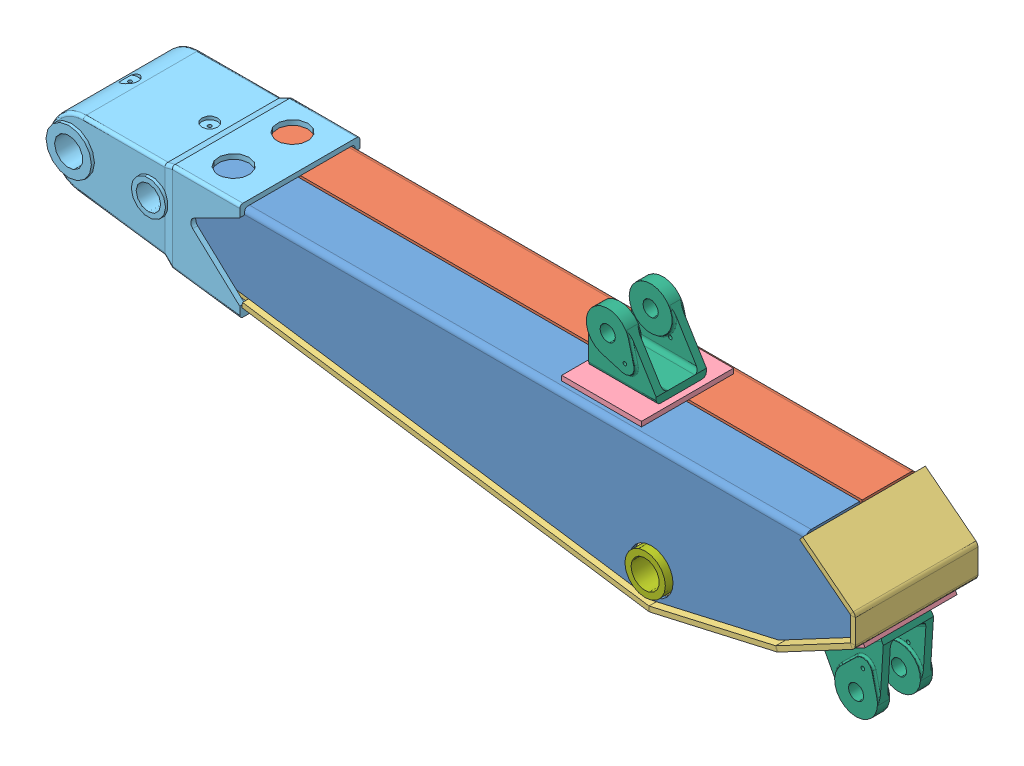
SolidWorks assembly ZLJX-XS-03-11A.SLDASM, configuration 默认 (file format 17000). Lengths in mm.
Overall size (1348.62 386.54 200).
9 component instances, 7 part files, 22 mates.
Components (placement in the parent):
- ZLJX-XS-03-11A-001-1-1: ZLJX-XS-03-11A-001-1.SLDPRT [默认] at (-817.4157 137.5187 0) size (1100 221 88)
- ZLJX-XS-03-11A-001-2-1: ZLJX-XS-03-11A-001-2.SLDPRT [默认] at (-817.4157 137.5187 -172) size (1100 221 88)
- ZLJX-XS-03-11A-002-1-1: ZLJX-XS-03-11A-002-1.SLDPRT [默认] at (285.4067 35.8717 -182) x (1 0.000022 0) z (0 0 1) size (1099.51 230.91 200)
- ZLJX-XS-03-11A-002-2-1: ZLJX-XS-03-11A-002-2.SLDPRT [默认] at (-80.4157 145.5187 -7) x (0 0 -1) z (0 1 0) size (150 130 8)
- ZLJX-Z-004-1: ZLJX-Z-004.SLDPRT [默认] at (-822.4157 92.5187 -82) x (-1 0 0) z (0 0 -1) size (314 161 200)
- ZLJX-Z-009-1: ZLJX-Z-009.SLDPRT [默认] at (225.7348 -15.1423 -82) x (0 0 -1) z (0.469799 -0.882773 0) size (90 110 102)
- ZLJX-Z-009-2: ZLJX-Z-009.SLDPRT [默认] at (-145.4157 153.5187 -82) x (0 0 1) z (0 1 0) size (90 110 102)
- ZLJX-XS-03-11A-002-2-2: ZLJX-XS-03-11A-002-2.SLDPRT [默认] at (284.173 15.9576 -7) x (0 0 -1) z (-0.469799 0.882773 0) size (150 130 8)
- ZLJX-XS-03-19-1: ZLJX-XS-03-19.SLDPRT [默认] at (-49.4157 -34.4813 -182) size (66 66 200)
Mates (geometry in assembly coordinates):
- 重合1: coincident aligned: plane of ZLJX-XS-03-11A-001-1-1 through (202.5843 145.5187 0) normal (0 1 0); plane of ZLJX-XS-03-11A-001-2-1 through (-817.4157 145.5187 -164) normal (0 1 0)
- 距离1: distance = 4 mm anti-aligned: plane of ZLJX-XS-03-11A-001-1-1 through (-817.4157 145.5187 -80) normal (0 0 -1); plane of ZLJX-XS-03-11A-001-2-1 through (-817.4157 145.5187 -84) normal (0 0 1)
- 重合3: coincident aligned: plane of ZLJX-XS-03-11A-001-1-1 through (-817.4157 145.5187 0) normal (-1 0 0); plane of ZLJX-XS-03-11A-001-2-1 through (-817.4157 145.5187 -164) normal (-1 0 0)
- 距离2: distance = 10 mm aligned: plane of ZLJX-XS-03-11A-001-1-1 through (-817.4157 137.5187 8) normal (0 0 1); plane of ZLJX-XS-03-11A-002-1-1 through (165.2677 -36.782 18) normal (0 0 1)
- 距离5: distance = 1 mm anti-aligned: plane of ZLJX-XS-03-11A-001-1-1 through (202.5843 145.5187 0) normal (0 1 0); plane of ZLJX-Z-004-1 through (-720.4157 146.5187 8) normal (0 -1 0)
- 重合9: coincident anti-aligned: plane of ZLJX-XS-03-11A-001-1-1 through (-817.4157 137.5187 8) normal (0 0 1); plane of ZLJX-Z-004-1 through (-822.4157 146.5187 8) normal (0 0 -1)
- 距离3: distance = 105 mm anti-aligned: plane of ZLJX-XS-03-11A-001-2-1 through (-817.4157 145.5187 -164) normal (-1 0 0); plane of ZLJX-Z-004-1 through (-712.4157 -6.4813 -180) normal (1 0 0)
- 重合25: coincident anti-aligned: plane of ZLJX-XS-03-11A-001-2-1 through (-47.4157 -75.4813 -164) normal (-0.145198 -0.989403 0); plane of ZLJX-XS-03-11A-002-1-1 through (-43.1056 -76.1138 18) normal (0.145198 0.989403 0)
- 距离12: distance = 3.5 mm: plane of ZLJX-XS-03-11A-002-1-1 through (-707.4574 11.2749 -182) normal (-0.989403 0.145198 0); line of ZLJX-Z-004-1 through (-712.4157 1.5928 3) axis (0 0 -1)
- 重合14: coincident anti-aligned: plane of ZLJX-XS-03-11A-001-1-1 through (202.5843 145.5187 0) normal (0 1 0); plane of ZLJX-XS-03-11A-002-2-1 through (-210.4157 145.5187 -7) normal (0 -1 0)
- 距离6: distance = 15 mm aligned: plane of ZLJX-XS-03-11A-001-1-1 through (-817.4157 137.5187 8) normal (0 0 1); plane of ZLJX-XS-03-11A-002-2-1 through (-80.4157 153.5187 -7) normal (0 0 1)
- 距离11: distance = 1 mm anti-aligned: plane of ZLJX-XS-03-11A-002-1-1 through (289.1651 28.8095 18) normal (0.469799 -0.882773 0); plane of ZLJX-XS-03-11A-002-2-2 through (165.654 -38.0541 -7) normal (-0.469799 0.882773 0)
- 重合17: coincident aligned: plane of ZLJX-XS-03-11A-002-2-1 through (-80.4157 153.5187 -7) normal (0 0 1); plane of ZLJX-XS-03-11A-002-2-2 through (280.4146 23.0198 -7) normal (0 0 1)
- 重合18: coincident anti-aligned: plane of ZLJX-XS-03-11A-002-2-1; plane of ZLJX-Z-009-2 through (-200.4157 153.5187 -123) normal (0 -1 0)
- 距离7: distance = 34 mm aligned: plane of ZLJX-XS-03-11A-002-2-1 through (-80.4157 153.5187 -7) normal (0 0 1); plane of ZLJX-Z-009-2 through (-90.4157 165.5187 -41) normal (0 0 1)
- 距离8: distance = 10 mm aligned: plane of ZLJX-XS-03-11A-002-2-1 through (-80.4157 153.5187 -7) normal (1 0 0); plane of ZLJX-Z-009-2 through (-90.4157 165.5187 -123) normal (1 0 0)
- 距离9: distance = 502 mm anti-aligned: plane of ZLJX-XS-03-11A-002-2-1 through (-210.4157 153.5187 -7) normal (-1 0 0); plane of ZLJX-Z-004-1 through (-712.4157 -6.4813 -180) normal (1 0 0)
- 重合22: coincident anti-aligned: plane of ZLJX-Z-009-1; plane of ZLJX-XS-03-11A-002-2-2
- 重合23: coincident aligned: plane of ZLJX-Z-009-1 through (279.9249 0.1033 -41) normal (0 0 1); plane of ZLJX-Z-009-2 through (-90.4157 165.5187 -41) normal (0 0 1)
- 距离10: distance = 186.5 mm: plane of ZLJX-XS-03-11A-001-1-1 through (202.5843 145.5187 0) normal (0 1 0); line of ZLJX-Z-009-1 through (177.1822 -40.9813 -48) axis (0 0 -1)
- 同心1: concentric aligned: cylinder of ZLJX-XS-03-11A-001-1-1 through (-49.4157 -34.4813 8) axis (0 0 -1) radius 35.5; cylinder of ZLJX-XS-03-19-1 through (-49.4157 -34.4813 18) axis (0 0 -1) radius 33
- 距离13: distance = 10 mm aligned: plane of ZLJX-XS-03-11A-001-1-1 through (-817.4157 137.5187 8) normal (0 0 1); plane of ZLJX-XS-03-19-1 through (-49.4157 -34.4813 18) normal (0 0 1)
